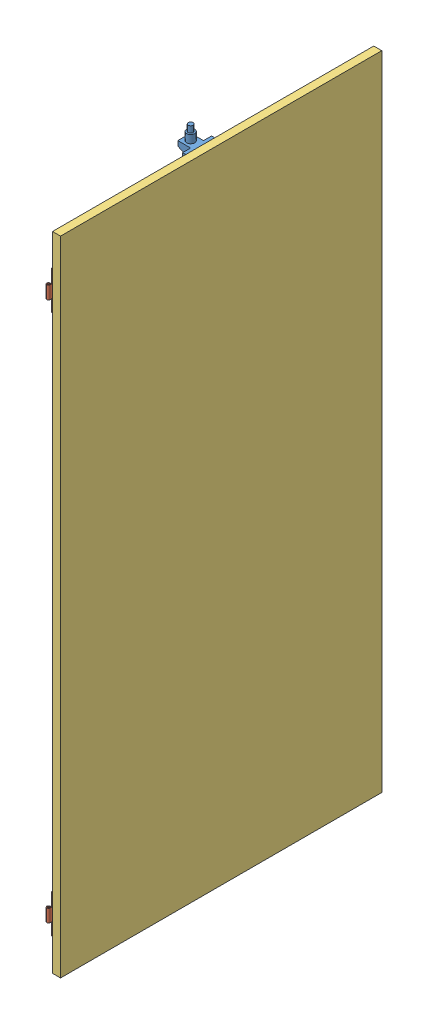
SolidWorks assembly Door-subassembly2.sldasm, configuration Default (file format 11000). Lengths in mm.
Overall size (75 2045 1012.5).
4 component instances, 3 part files, 0 mates.
Components (placement in the parent):
- mount2-1: mount2.sldprt [Default] at (-987.5 -95 515) size (50 105 90)
- hingep2-1: hingep2.sldprt [Default] at (-973.6937 -1875 1022.0901) x (0 0 -1) z (0 1 0) size (65 10 120)
- hingep2-2: hingep2.sldprt [Default] at (-973.6937 -195 1022.0901) x (0 0 -1) z (0 1 0) size (65 10 120)
- door-1: door.sldprt [Default] at (-965 -35 -25) x (0 0 -1) z (1 0 0) size (1000 2000 25)
